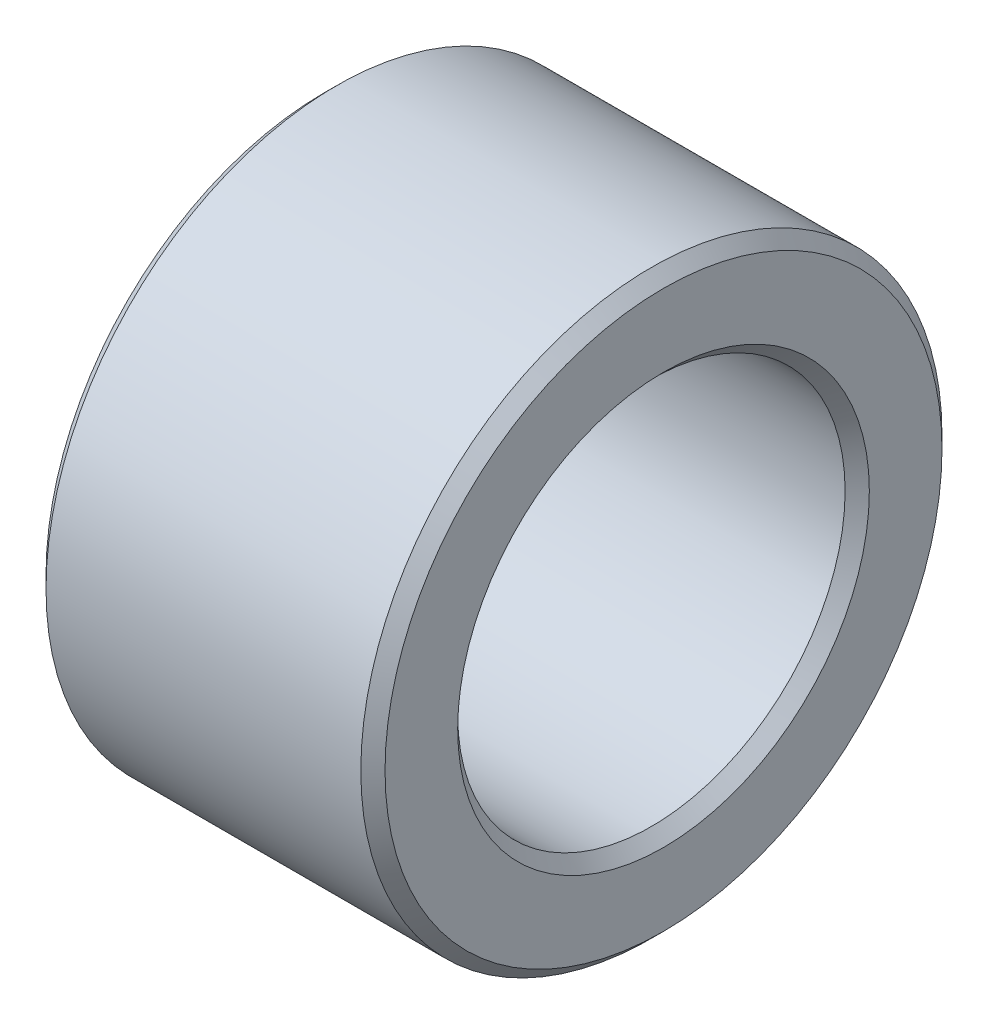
ISO-10303-21;
HEADER;
FILE_DESCRIPTION(('STEP AP214'),'2;1');
FILE_NAME('part.step','',(''),(''),'','','');
FILE_SCHEMA(('AUTOMOTIVE_DESIGN { 1 0 10303 214 1 1 1 1 }'));
ENDSEC;
DATA;
#1=APPLICATION_CONTEXT('core data for automotive mechanical design processes');
#2=APPLICATION_PROTOCOL_DEFINITION('international standard','automotive_design',2000,#1);
#3=PRODUCT_CONTEXT('',#1,'mechanical');
#4=PRODUCT('Part','Part','',(#3));
#5=PRODUCT_RELATED_PRODUCT_CATEGORY('part','',(#4));
#6=PRODUCT_DEFINITION_FORMATION('','',#4);
#7=PRODUCT_DEFINITION_CONTEXT('part definition',#1,'design');
#8=PRODUCT_DEFINITION('design','',#6,#7);
#9=PRODUCT_DEFINITION_SHAPE('','',#8);
#10=(LENGTH_UNIT() NAMED_UNIT(*) SI_UNIT(.MILLI.,.METRE.));
#11=(NAMED_UNIT(*) PLANE_ANGLE_UNIT() SI_UNIT($,.RADIAN.));
#12=(NAMED_UNIT(*) SI_UNIT($,.STERADIAN.) SOLID_ANGLE_UNIT());
#13=UNCERTAINTY_MEASURE_WITH_UNIT(LENGTH_MEASURE(1.E-05),#10,'distance_accuracy_value','');
#14=(GEOMETRIC_REPRESENTATION_CONTEXT(3) GLOBAL_UNCERTAINTY_ASSIGNED_CONTEXT((#13)) GLOBAL_UNIT_ASSIGNED_CONTEXT((#10,
#11,#12)) REPRESENTATION_CONTEXT('',''));
#15=CARTESIAN_POINT('',(0.,0.,0.));
#16=DIRECTION('',(0.,0.,1.));
#17=DIRECTION('',(1.,0.,0.));
#18=AXIS2_PLACEMENT_3D('',#15,#16,#17);
#19=CARTESIAN_POINT('',(7.,0.,0.));
#20=DIRECTION('',(1.,0.,0.));
#21=DIRECTION('',(0.,0.,-1.));
#22=AXIS2_PLACEMENT_3D('',#19,#20,#21);
#23=PLANE('',#22);
#24=CARTESIAN_POINT('',(7.,0.,0.));
#25=DIRECTION('',(1.,0.,0.));
#26=DIRECTION('',(0.,0.,-1.));
#27=AXIS2_PLACEMENT_3D('',#24,#25,#26);
#28=CIRCLE('',#27,4.25);
#29=CARTESIAN_POINT('',(7.,0.,-4.25));
#30=VERTEX_POINT('',#29);
#31=EDGE_CURVE('E40',#30,#30,#28,.F.);
#32=ORIENTED_EDGE('',*,*,#31,.T.);
#33=EDGE_LOOP('',(#32));
#34=FACE_BOUND('',#33,.T.);
#35=CARTESIAN_POINT('',(7.,0.,0.));
#36=DIRECTION('',(1.,0.,0.));
#37=DIRECTION('',(0.,0.,-1.));
#38=AXIS2_PLACEMENT_3D('',#35,#36,#37);
#39=CIRCLE('',#38,5.75000000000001);
#40=CARTESIAN_POINT('',(7.,0.,-5.75000000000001));
#41=VERTEX_POINT('',#40);
#42=EDGE_CURVE('E44',#41,#41,#39,.T.);
#43=ORIENTED_EDGE('',*,*,#42,.T.);
#44=EDGE_LOOP('',(#43));
#45=FACE_BOUND('',#44,.T.);
#46=ADVANCED_FACE('F29',(#34,#45),#23,.T.);
#47=CARTESIAN_POINT('',(0.,0.,0.));
#48=DIRECTION('',(1.,0.,0.));
#49=DIRECTION('',(0.,0.,-1.));
#50=AXIS2_PLACEMENT_3D('',#47,#48,#49);
#51=PLANE('',#50);
#52=CARTESIAN_POINT('',(0.,0.,0.));
#53=DIRECTION('',(1.,0.,0.));
#54=DIRECTION('',(0.,0.,-1.));
#55=AXIS2_PLACEMENT_3D('',#52,#53,#54);
#56=CIRCLE('',#55,4.25);
#57=CARTESIAN_POINT('',(0.,0.,-4.25));
#58=VERTEX_POINT('',#57);
#59=EDGE_CURVE('E55',#58,#58,#56,.T.);
#60=ORIENTED_EDGE('',*,*,#59,.T.);
#61=EDGE_LOOP('',(#60));
#62=FACE_BOUND('',#61,.T.);
#63=CARTESIAN_POINT('',(0.,0.,0.));
#64=DIRECTION('',(1.,0.,0.));
#65=DIRECTION('',(0.,0.,-1.));
#66=AXIS2_PLACEMENT_3D('',#63,#64,#65);
#67=CIRCLE('',#66,5.75);
#68=CARTESIAN_POINT('',(0.,0.,-5.75));
#69=VERTEX_POINT('',#68);
#70=EDGE_CURVE('E58',#69,#69,#67,.F.);
#71=ORIENTED_EDGE('',*,*,#70,.T.);
#72=EDGE_LOOP('',(#71));
#73=FACE_BOUND('',#72,.T.);
#74=ADVANCED_FACE('F62',(#62,#73),#51,.F.);
#75=CARTESIAN_POINT('',(7.,0.,0.));
#76=DIRECTION('',(-1.,0.,0.));
#77=DIRECTION('',(0.,0.,1.));
#78=AXIS2_PLACEMENT_3D('',#75,#76,#77);
#79=CYLINDRICAL_SURFACE('',#78,6.);
#80=CARTESIAN_POINT('',(0.249999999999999,0.,0.));
#81=DIRECTION('',(1.,0.,0.));
#82=DIRECTION('',(0.,0.,-1.));
#83=AXIS2_PLACEMENT_3D('',#80,#81,#82);
#84=CIRCLE('',#83,6.);
#85=CARTESIAN_POINT('',(0.249999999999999,0.,-6.));
#86=VERTEX_POINT('',#85);
#87=EDGE_CURVE('E10',#86,#86,#84,.T.);
#88=ORIENTED_EDGE('',*,*,#87,.T.);
#89=EDGE_LOOP('',(#88));
#90=FACE_BOUND('',#89,.T.);
#91=CARTESIAN_POINT('',(6.75,0.,0.));
#92=DIRECTION('',(1.,0.,0.));
#93=DIRECTION('',(0.,0.,-1.));
#94=AXIS2_PLACEMENT_3D('',#91,#92,#93);
#95=CIRCLE('',#94,6.);
#96=CARTESIAN_POINT('',(6.75,0.,-6.));
#97=VERTEX_POINT('',#96);
#98=EDGE_CURVE('E36',#97,#97,#95,.F.);
#99=ORIENTED_EDGE('',*,*,#98,.T.);
#100=EDGE_LOOP('',(#99));
#101=FACE_BOUND('',#100,.T.);
#102=ADVANCED_FACE('F82',(#90,#101),#79,.T.);
#103=CARTESIAN_POINT('',(7.,0.,0.));
#104=DIRECTION('',(-1.,0.,0.));
#105=DIRECTION('',(0.,0.,1.));
#106=AXIS2_PLACEMENT_3D('',#103,#104,#105);
#107=CYLINDRICAL_SURFACE('',#106,4.);
#108=CARTESIAN_POINT('',(0.250000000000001,0.,0.));
#109=DIRECTION('',(1.,0.,0.));
#110=DIRECTION('',(0.,0.,-1.));
#111=AXIS2_PLACEMENT_3D('',#108,#109,#110);
#112=CIRCLE('',#111,4.);
#113=CARTESIAN_POINT('',(0.250000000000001,0.,-4.));
#114=VERTEX_POINT('',#113);
#115=EDGE_CURVE('E49',#114,#114,#112,.F.);
#116=ORIENTED_EDGE('',*,*,#115,.T.);
#117=EDGE_LOOP('',(#116));
#118=FACE_BOUND('',#117,.T.);
#119=CARTESIAN_POINT('',(6.75,0.,0.));
#120=DIRECTION('',(1.,0.,0.));
#121=DIRECTION('',(0.,0.,-1.));
#122=AXIS2_PLACEMENT_3D('',#119,#120,#121);
#123=CIRCLE('',#122,4.);
#124=CARTESIAN_POINT('',(6.75,0.,-4.));
#125=VERTEX_POINT('',#124);
#126=EDGE_CURVE('E52',#125,#125,#123,.T.);
#127=ORIENTED_EDGE('',*,*,#126,.T.);
#128=EDGE_LOOP('',(#127));
#129=FACE_BOUND('',#128,.T.);
#130=ADVANCED_FACE('F87',(#118,#129),#107,.F.);
#131=CARTESIAN_POINT('',(0.,0.,0.));
#132=DIRECTION('',(-1.,0.,0.));
#133=DIRECTION('',(0.,0.,1.));
#134=AXIS2_PLACEMENT_3D('',#131,#132,#133);
#135=CONICAL_SURFACE('',#134,4.25,0.785398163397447);
#136=ORIENTED_EDGE('',*,*,#115,.F.);
#137=EDGE_LOOP('',(#136));
#138=FACE_BOUND('',#137,.T.);
#139=ORIENTED_EDGE('',*,*,#59,.F.);
#140=EDGE_LOOP('',(#139));
#141=FACE_BOUND('',#140,.T.);
#142=ADVANCED_FACE('F73',(#138,#141),#135,.F.);
#143=CARTESIAN_POINT('',(6.75,0.,0.));
#144=DIRECTION('',(1.,0.,0.));
#145=DIRECTION('',(0.,0.,-1.));
#146=AXIS2_PLACEMENT_3D('',#143,#144,#145);
#147=CONICAL_SURFACE('',#146,4.,0.785398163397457);
#148=ORIENTED_EDGE('',*,*,#31,.F.);
#149=EDGE_LOOP('',(#148));
#150=FACE_BOUND('',#149,.T.);
#151=ORIENTED_EDGE('',*,*,#126,.F.);
#152=EDGE_LOOP('',(#151));
#153=FACE_BOUND('',#152,.T.);
#154=ADVANCED_FACE('F67',(#150,#153),#147,.F.);
#155=CARTESIAN_POINT('',(0.249999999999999,0.,0.));
#156=DIRECTION('',(1.,0.,0.));
#157=DIRECTION('',(0.,0.,-1.));
#158=AXIS2_PLACEMENT_3D('',#155,#156,#157);
#159=CONICAL_SURFACE('',#158,6.,0.785398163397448);
#160=ORIENTED_EDGE('',*,*,#70,.F.);
#161=EDGE_LOOP('',(#160));
#162=FACE_BOUND('',#161,.T.);
#163=ORIENTED_EDGE('',*,*,#87,.F.);
#164=EDGE_LOOP('',(#163));
#165=FACE_BOUND('',#164,.T.);
#166=ADVANCED_FACE('F64',(#162,#165),#159,.T.);
#167=CARTESIAN_POINT('',(7.,0.,0.));
#168=DIRECTION('',(-1.,0.,0.));
#169=DIRECTION('',(0.,0.,1.));
#170=AXIS2_PLACEMENT_3D('',#167,#168,#169);
#171=CONICAL_SURFACE('',#170,5.75000000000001,0.785398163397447);
#172=ORIENTED_EDGE('',*,*,#98,.F.);
#173=EDGE_LOOP('',(#172));
#174=FACE_BOUND('',#173,.T.);
#175=ORIENTED_EDGE('',*,*,#42,.F.);
#176=EDGE_LOOP('',(#175));
#177=FACE_BOUND('',#176,.T.);
#178=ADVANCED_FACE('F31',(#174,#177),#171,.T.);
#179=CLOSED_SHELL('',(#46,#74,#102,#130,#142,#154,#166,#178));
#180=MANIFOLD_SOLID_BREP('B2',#179);
#181=ADVANCED_BREP_SHAPE_REPRESENTATION('',(#18,#180),#14);
#182=SHAPE_DEFINITION_REPRESENTATION(#9,#181);
ENDSEC;
END-ISO-10303-21;
